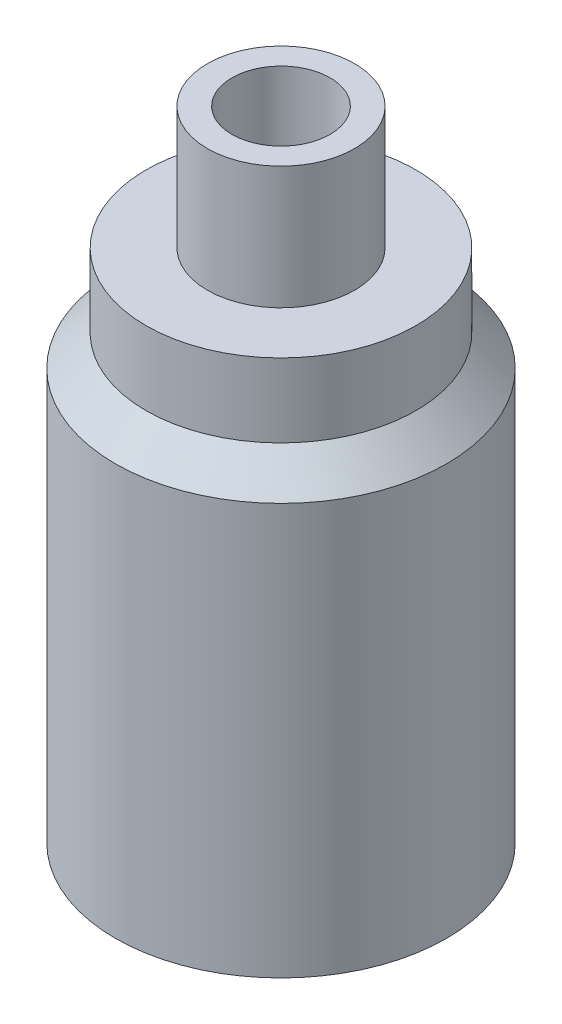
ISO-10303-21;
HEADER;
FILE_DESCRIPTION(('STEP AP214'),'2;1');
FILE_NAME('part.step','',(''),(''),'','','');
FILE_SCHEMA(('AUTOMOTIVE_DESIGN { 1 0 10303 214 1 1 1 1 }'));
ENDSEC;
DATA;
#1=APPLICATION_CONTEXT('core data for automotive mechanical design processes');
#2=APPLICATION_PROTOCOL_DEFINITION('international standard','automotive_design',2000,#1);
#3=PRODUCT_CONTEXT('',#1,'mechanical');
#4=PRODUCT('Part','Part','',(#3));
#5=PRODUCT_RELATED_PRODUCT_CATEGORY('part','',(#4));
#6=PRODUCT_DEFINITION_FORMATION('','',#4);
#7=PRODUCT_DEFINITION_CONTEXT('part definition',#1,'design');
#8=PRODUCT_DEFINITION('design','',#6,#7);
#9=PRODUCT_DEFINITION_SHAPE('','',#8);
#10=(LENGTH_UNIT() NAMED_UNIT(*) SI_UNIT(.MILLI.,.METRE.));
#11=(NAMED_UNIT(*) PLANE_ANGLE_UNIT() SI_UNIT($,.RADIAN.));
#12=(NAMED_UNIT(*) SI_UNIT($,.STERADIAN.) SOLID_ANGLE_UNIT());
#13=UNCERTAINTY_MEASURE_WITH_UNIT(LENGTH_MEASURE(1.E-05),#10,'distance_accuracy_value','');
#14=(GEOMETRIC_REPRESENTATION_CONTEXT(3) GLOBAL_UNCERTAINTY_ASSIGNED_CONTEXT((#13)) GLOBAL_UNIT_ASSIGNED_CONTEXT((#10,
#11,#12)) REPRESENTATION_CONTEXT('',''));
#15=CARTESIAN_POINT('',(0.,0.,0.));
#16=DIRECTION('',(0.,0.,1.));
#17=DIRECTION('',(1.,0.,0.));
#18=AXIS2_PLACEMENT_3D('',#15,#16,#17);
#19=CARTESIAN_POINT('',(0.,21.,0.));
#20=DIRECTION('',(0.,1.,0.));
#21=DIRECTION('',(0.,0.,1.));
#22=AXIS2_PLACEMENT_3D('',#19,#20,#21);
#23=PLANE('',#22);
#24=CARTESIAN_POINT('',(0.,21.,0.));
#25=DIRECTION('',(0.,1.,0.));
#26=DIRECTION('',(0.,0.,1.));
#27=AXIS2_PLACEMENT_3D('',#24,#25,#26);
#28=CIRCLE('',#27,3.);
#29=CARTESIAN_POINT('',(0.,21.,3.));
#30=VERTEX_POINT('',#29);
#31=EDGE_CURVE('E49',#30,#30,#28,.T.);
#32=ORIENTED_EDGE('',*,*,#31,.F.);
#33=EDGE_LOOP('',(#32));
#34=FACE_BOUND('',#33,.T.);
#35=CARTESIAN_POINT('',(0.,21.,0.));
#36=DIRECTION('',(0.,1.,0.));
#37=DIRECTION('',(0.,0.,1.));
#38=AXIS2_PLACEMENT_3D('',#35,#36,#37);
#39=CIRCLE('',#38,5.5);
#40=CARTESIAN_POINT('',(0.,21.,5.5));
#41=VERTEX_POINT('',#40);
#42=EDGE_CURVE('E58',#41,#41,#39,.T.);
#43=ORIENTED_EDGE('',*,*,#42,.T.);
#44=EDGE_LOOP('',(#43));
#45=FACE_BOUND('',#44,.T.);
#46=ADVANCED_FACE('F37',(#34,#45),#23,.T.);
#47=CARTESIAN_POINT('',(0.,21.,0.));
#48=DIRECTION('',(0.,1.,0.));
#49=DIRECTION('',(0.,0.,1.));
#50=AXIS2_PLACEMENT_3D('',#47,#48,#49);
#51=CYLINDRICAL_SURFACE('',#50,3.);
#52=ORIENTED_EDGE('',*,*,#31,.T.);
#53=EDGE_LOOP('',(#52));
#54=FACE_BOUND('',#53,.T.);
#55=CARTESIAN_POINT('',(0.,26.,0.));
#56=DIRECTION('',(0.,1.,0.));
#57=DIRECTION('',(0.,0.,1.));
#58=AXIS2_PLACEMENT_3D('',#55,#56,#57);
#59=CIRCLE('',#58,3.);
#60=CARTESIAN_POINT('',(0.,26.,3.));
#61=VERTEX_POINT('',#60);
#62=EDGE_CURVE('E52',#61,#61,#59,.T.);
#63=ORIENTED_EDGE('',*,*,#62,.F.);
#64=EDGE_LOOP('',(#63));
#65=FACE_BOUND('',#64,.T.);
#66=ADVANCED_FACE('F89',(#54,#65),#51,.T.);
#67=CARTESIAN_POINT('',(0.,26.,0.));
#68=DIRECTION('',(0.,1.,0.));
#69=DIRECTION('',(0.,0.,1.));
#70=AXIS2_PLACEMENT_3D('',#67,#68,#69);
#71=PLANE('',#70);
#72=CARTESIAN_POINT('',(0.,26.,0.));
#73=DIRECTION('',(0.,1.,0.));
#74=DIRECTION('',(0.,0.,1.));
#75=AXIS2_PLACEMENT_3D('',#72,#73,#74);
#76=CIRCLE('',#75,2.);
#77=CARTESIAN_POINT('',(0.,26.,2.));
#78=VERTEX_POINT('',#77);
#79=EDGE_CURVE('E69',#78,#78,#76,.T.);
#80=ORIENTED_EDGE('',*,*,#79,.F.);
#81=EDGE_LOOP('',(#80));
#82=FACE_BOUND('',#81,.T.);
#83=ORIENTED_EDGE('',*,*,#62,.T.);
#84=EDGE_LOOP('',(#83));
#85=FACE_BOUND('',#84,.T.);
#86=ADVANCED_FACE('F95',(#82,#85),#71,.T.);
#87=CARTESIAN_POINT('',(0.,18.,0.));
#88=DIRECTION('',(0.,1.,0.));
#89=DIRECTION('',(0.,0.,1.));
#90=AXIS2_PLACEMENT_3D('',#87,#88,#89);
#91=CYLINDRICAL_SURFACE('',#90,5.5);
#92=CARTESIAN_POINT('',(0.,18.,0.));
#93=DIRECTION('',(0.,1.,0.));
#94=DIRECTION('',(0.,0.,1.));
#95=AXIS2_PLACEMENT_3D('',#92,#93,#94);
#96=CIRCLE('',#95,5.5);
#97=CARTESIAN_POINT('',(0.,18.,-5.50000000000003));
#98=VERTEX_POINT('',#97);
#99=EDGE_CURVE('E55',#98,#98,#96,.T.);
#100=ORIENTED_EDGE('',*,*,#99,.T.);
#101=EDGE_LOOP('',(#100));
#102=FACE_BOUND('',#101,.T.);
#103=ORIENTED_EDGE('',*,*,#42,.F.);
#104=EDGE_LOOP('',(#103));
#105=FACE_BOUND('',#104,.T.);
#106=ADVANCED_FACE('F104',(#102,#105),#91,.T.);
#107=CARTESIAN_POINT('',(0.,0.,0.));
#108=DIRECTION('',(0.,1.,0.));
#109=DIRECTION('',(0.,0.,1.));
#110=AXIS2_PLACEMENT_3D('',#107,#108,#109);
#111=PLANE('',#110);
#112=CARTESIAN_POINT('',(0.,0.,0.));
#113=DIRECTION('',(0.,-1.,0.));
#114=DIRECTION('',(0.,0.,-1.));
#115=AXIS2_PLACEMENT_3D('',#112,#113,#114);
#116=CIRCLE('',#115,3.25);
#117=CARTESIAN_POINT('',(0.,0.,-3.25));
#118=VERTEX_POINT('',#117);
#119=EDGE_CURVE('E66',#118,#118,#116,.T.);
#120=ORIENTED_EDGE('',*,*,#119,.F.);
#121=EDGE_LOOP('',(#120));
#122=FACE_BOUND('',#121,.T.);
#123=CARTESIAN_POINT('',(0.,0.,0.));
#124=DIRECTION('',(0.,1.,0.));
#125=DIRECTION('',(0.,0.,1.));
#126=AXIS2_PLACEMENT_3D('',#123,#124,#125);
#127=CIRCLE('',#126,6.75);
#128=CARTESIAN_POINT('',(0.,0.,-6.75));
#129=VERTEX_POINT('',#128);
#130=EDGE_CURVE('E45',#129,#129,#127,.T.);
#131=ORIENTED_EDGE('',*,*,#130,.F.);
#132=EDGE_LOOP('',(#131));
#133=FACE_BOUND('',#132,.T.);
#134=ADVANCED_FACE('F106',(#122,#133),#111,.F.);
#135=CARTESIAN_POINT('',(0.,26.,0.));
#136=DIRECTION('',(0.,-1.,0.));
#137=DIRECTION('',(0.,0.,-1.));
#138=AXIS2_PLACEMENT_3D('',#135,#136,#137);
#139=CYLINDRICAL_SURFACE('',#138,6.75);
#140=CARTESIAN_POINT('',(0.,16.75,0.));
#141=DIRECTION('',(0.,1.,0.));
#142=DIRECTION('',(0.,0.,1.));
#143=AXIS2_PLACEMENT_3D('',#140,#141,#142);
#144=CIRCLE('',#143,6.75);
#145=CARTESIAN_POINT('',(0.,16.75,-6.75));
#146=VERTEX_POINT('',#145);
#147=EDGE_CURVE('E11',#146,#146,#144,.F.);
#148=CARTESIAN_POINT('',(0.,16.75,-6.75));
#149=CARTESIAN_POINT('',(0.,16.5755208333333,-6.75));
#150=CARTESIAN_POINT('',(0.,16.4010416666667,-6.75));
#151=CARTESIAN_POINT('',(0.,16.0520833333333,-6.75));
#152=CARTESIAN_POINT('',(0.,15.8776041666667,-6.75));
#153=CARTESIAN_POINT('',(0.,15.5286458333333,-6.75));
#154=CARTESIAN_POINT('',(0.,15.3541666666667,-6.75));
#155=CARTESIAN_POINT('',(0.,15.0052083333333,-6.75));
#156=CARTESIAN_POINT('',(0.,14.8307291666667,-6.75));
#157=CARTESIAN_POINT('',(0.,14.4817708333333,-6.75));
#158=CARTESIAN_POINT('',(0.,14.3072916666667,-6.75));
#159=CARTESIAN_POINT('',(0.,13.9583333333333,-6.75));
#160=CARTESIAN_POINT('',(0.,13.7838541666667,-6.75));
#161=CARTESIAN_POINT('',(0.,13.4348958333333,-6.75));
#162=CARTESIAN_POINT('',(0.,13.2604166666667,-6.75));
#163=CARTESIAN_POINT('',(0.,12.9114583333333,-6.75));
#164=CARTESIAN_POINT('',(0.,12.7369791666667,-6.75));
#165=CARTESIAN_POINT('',(0.,12.3880208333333,-6.75));
#166=CARTESIAN_POINT('',(0.,12.2135416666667,-6.75));
#167=CARTESIAN_POINT('',(0.,11.8645833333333,-6.75));
#168=CARTESIAN_POINT('',(0.,11.6901041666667,-6.75));
#169=CARTESIAN_POINT('',(0.,11.3411458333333,-6.75));
#170=CARTESIAN_POINT('',(0.,11.1666666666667,-6.75));
#171=CARTESIAN_POINT('',(0.,10.8177083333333,-6.75));
#172=CARTESIAN_POINT('',(0.,10.6432291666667,-6.75));
#173=CARTESIAN_POINT('',(0.,10.2942708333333,-6.75));
#174=CARTESIAN_POINT('',(0.,10.1197916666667,-6.75));
#175=CARTESIAN_POINT('',(0.,9.77083333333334,-6.75));
#176=CARTESIAN_POINT('',(0.,9.59635416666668,-6.75));
#177=CARTESIAN_POINT('',(0.,9.24739583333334,-6.75));
#178=CARTESIAN_POINT('',(0.,9.07291666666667,-6.75));
#179=CARTESIAN_POINT('',(0.,8.72395833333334,-6.75));
#180=CARTESIAN_POINT('',(0.,8.54947916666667,-6.75));
#181=CARTESIAN_POINT('',(0.,8.20052083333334,-6.75));
#182=CARTESIAN_POINT('',(0.,8.02604166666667,-6.75));
#183=CARTESIAN_POINT('',(0.,7.67708333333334,-6.75));
#184=CARTESIAN_POINT('',(0.,7.50260416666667,-6.75));
#185=CARTESIAN_POINT('',(0.,7.15364583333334,-6.75));
#186=CARTESIAN_POINT('',(0.,6.97916666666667,-6.75));
#187=CARTESIAN_POINT('',(0.,6.63020833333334,-6.75));
#188=CARTESIAN_POINT('',(0.,6.45572916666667,-6.75));
#189=CARTESIAN_POINT('',(0.,6.10677083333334,-6.75));
#190=CARTESIAN_POINT('',(0.,5.93229166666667,-6.75));
#191=CARTESIAN_POINT('',(0.,5.58333333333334,-6.75));
#192=CARTESIAN_POINT('',(0.,5.40885416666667,-6.75));
#193=CARTESIAN_POINT('',(0.,5.05989583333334,-6.75));
#194=CARTESIAN_POINT('',(0.,4.88541666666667,-6.75));
#195=CARTESIAN_POINT('',(0.,4.53645833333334,-6.75));
#196=CARTESIAN_POINT('',(0.,4.36197916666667,-6.75));
#197=CARTESIAN_POINT('',(0.,4.01302083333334,-6.75));
#198=CARTESIAN_POINT('',(0.,3.83854166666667,-6.75));
#199=CARTESIAN_POINT('',(0.,3.48958333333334,-6.75));
#200=CARTESIAN_POINT('',(0.,3.31510416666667,-6.75));
#201=CARTESIAN_POINT('',(0.,2.96614583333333,-6.75));
#202=CARTESIAN_POINT('',(0.,2.79166666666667,-6.75));
#203=CARTESIAN_POINT('',(0.,2.44270833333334,-6.75));
#204=CARTESIAN_POINT('',(0.,2.26822916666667,-6.75));
#205=CARTESIAN_POINT('',(0.,1.91927083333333,-6.75));
#206=CARTESIAN_POINT('',(0.,1.74479166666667,-6.75));
#207=CARTESIAN_POINT('',(0.,1.39583333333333,-6.75));
#208=CARTESIAN_POINT('',(0.,1.22135416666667,-6.75));
#209=CARTESIAN_POINT('',(0.,0.872395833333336,-6.75));
#210=CARTESIAN_POINT('',(0.,0.697916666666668,-6.75));
#211=CARTESIAN_POINT('',(0.,0.348958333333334,-6.75));
#212=CARTESIAN_POINT('',(0.,0.174479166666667,-6.75));
#213=CARTESIAN_POINT('',(0.,0.,-6.75));
#214=B_SPLINE_CURVE_WITH_KNOTS('',3,(#148,#149,#150,#151,#152,#153,#154,#155,#156,#157,#158,
#159,#160,#161,#162,#163,#164,#165,#166,#167,#168,#169,#170,#171,#172,#173,#174,#175,#176,#177,
#178,#179,#180,#181,#182,#183,#184,#185,#186,#187,#188,#189,#190,#191,#192,#193,#194,#195,#196,
#197,#198,#199,#200,#201,#202,#203,#204,#205,#206,#207,#208,#209,#210,#211,#212,#213),
.UNSPECIFIED.,.F.,.F.,(4,2,2,2,2,2,2,2,2,2,2,2,2,2,2,2,2,2,2,2,2,2,2,2,2,2,2,2,2,2,2,2,4),(0.,
0.523437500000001,1.046875,1.5703125,2.09375,2.6171875,3.140625,3.6640625,4.18750000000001,
4.71093750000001,5.23437500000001,5.75781250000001,6.28125000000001,6.80468750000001,7.328125,
7.85156250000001,8.37500000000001,8.89843750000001,9.42187500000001,9.94531250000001,10.46875,
10.9921875,11.515625,12.0390625,12.5625,13.0859375,13.609375,14.1328125,14.65625,15.1796875,
15.703125,16.2265625,16.75),.UNSPECIFIED.);
#215=EDGE_CURVE('BSEAM108',#146,#129,#214,.T.);
#216=ORIENTED_EDGE('',*,*,#147,.T.);
#217=ORIENTED_EDGE('',*,*,#130,.T.);
#218=ORIENTED_EDGE('',*,*,#215,.T.);
#219=ORIENTED_EDGE('',*,*,#215,.F.);
#220=EDGE_LOOP('',(#216,#218,#217,#219));
#221=FACE_BOUND('',#220,.T.);
#222=ADVANCED_FACE('F108',(#221),#139,.T.);
#223=CARTESIAN_POINT('',(0.,18.,0.));
#224=DIRECTION('',(0.,-1.,0.));
#225=DIRECTION('',(0.,0.,-1.));
#226=AXIS2_PLACEMENT_3D('',#223,#224,#225);
#227=CONICAL_SURFACE('',#226,5.50000000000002,0.785398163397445);
#228=CARTESIAN_POINT('',(0.,16.75,-6.75));
#229=CARTESIAN_POINT('',(0.,16.7630208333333,-6.73697916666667));
#230=CARTESIAN_POINT('',(0.,16.7760416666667,-6.72395833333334));
#231=CARTESIAN_POINT('',(0.,16.8020833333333,-6.69791666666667));
#232=CARTESIAN_POINT('',(0.,16.8151041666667,-6.68489583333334));
#233=CARTESIAN_POINT('',(0.,16.8411458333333,-6.65885416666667));
#234=CARTESIAN_POINT('',(0.,16.8541666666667,-6.64583333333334));
#235=CARTESIAN_POINT('',(0.,16.8802083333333,-6.61979166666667));
#236=CARTESIAN_POINT('',(0.,16.8932291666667,-6.60677083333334));
#237=CARTESIAN_POINT('',(0.,16.9192708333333,-6.58072916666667));
#238=CARTESIAN_POINT('',(0.,16.9322916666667,-6.56770833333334));
#239=CARTESIAN_POINT('',(0.,16.9583333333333,-6.54166666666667));
#240=CARTESIAN_POINT('',(0.,16.9713541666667,-6.52864583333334));
#241=CARTESIAN_POINT('',(0.,16.9973958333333,-6.50260416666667));
#242=CARTESIAN_POINT('',(0.,17.0104166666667,-6.48958333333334));
#243=CARTESIAN_POINT('',(0.,17.0364583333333,-6.46354166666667));
#244=CARTESIAN_POINT('',(0.,17.0494791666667,-6.45052083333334));
#245=CARTESIAN_POINT('',(0.,17.0755208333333,-6.42447916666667));
#246=CARTESIAN_POINT('',(0.,17.0885416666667,-6.41145833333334));
#247=CARTESIAN_POINT('',(0.,17.1145833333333,-6.38541666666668));
#248=CARTESIAN_POINT('',(0.,17.1276041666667,-6.37239583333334));
#249=CARTESIAN_POINT('',(0.,17.1536458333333,-6.34635416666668));
#250=CARTESIAN_POINT('',(0.,17.1666666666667,-6.33333333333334));
#251=CARTESIAN_POINT('',(0.,17.1927083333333,-6.30729166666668));
#252=CARTESIAN_POINT('',(0.,17.2057291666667,-6.29427083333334));
#253=CARTESIAN_POINT('',(0.,17.2317708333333,-6.26822916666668));
#254=CARTESIAN_POINT('',(0.,17.2447916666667,-6.25520833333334));
#255=CARTESIAN_POINT('',(0.,17.2708333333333,-6.22916666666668));
#256=CARTESIAN_POINT('',(0.,17.2838541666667,-6.21614583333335));
#257=CARTESIAN_POINT('',(0.,17.3098958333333,-6.19010416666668));
#258=CARTESIAN_POINT('',(0.,17.3229166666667,-6.17708333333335));
#259=CARTESIAN_POINT('',(0.,17.3489583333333,-6.15104166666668));
#260=CARTESIAN_POINT('',(0.,17.3619791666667,-6.13802083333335));
#261=CARTESIAN_POINT('',(0.,17.3880208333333,-6.11197916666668));
#262=CARTESIAN_POINT('',(0.,17.4010416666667,-6.09895833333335));
#263=CARTESIAN_POINT('',(0.,17.4270833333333,-6.07291666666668));
#264=CARTESIAN_POINT('',(0.,17.4401041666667,-6.05989583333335));
#265=CARTESIAN_POINT('',(0.,17.4661458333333,-6.03385416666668));
#266=CARTESIAN_POINT('',(0.,17.4791666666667,-6.02083333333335));
#267=CARTESIAN_POINT('',(0.,17.5052083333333,-5.99479166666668));
#268=CARTESIAN_POINT('',(0.,17.5182291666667,-5.98177083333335));
#269=CARTESIAN_POINT('',(0.,17.5442708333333,-5.95572916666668));
#270=CARTESIAN_POINT('',(0.,17.5572916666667,-5.94270833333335));
#271=CARTESIAN_POINT('',(0.,17.5833333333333,-5.91666666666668));
#272=CARTESIAN_POINT('',(0.,17.5963541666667,-5.90364583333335));
#273=CARTESIAN_POINT('',(0.,17.6223958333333,-5.87760416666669));
#274=CARTESIAN_POINT('',(0.,17.6354166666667,-5.86458333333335));
#275=CARTESIAN_POINT('',(0.,17.6614583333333,-5.83854166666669));
#276=CARTESIAN_POINT('',(0.,17.6744791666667,-5.82552083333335));
#277=CARTESIAN_POINT('',(0.,17.7005208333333,-5.79947916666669));
#278=CARTESIAN_POINT('',(0.,17.7135416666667,-5.78645833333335));
#279=CARTESIAN_POINT('',(0.,17.7395833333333,-5.76041666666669));
#280=CARTESIAN_POINT('',(0.,17.7526041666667,-5.74739583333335));
#281=CARTESIAN_POINT('',(0.,17.7786458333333,-5.72135416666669));
#282=CARTESIAN_POINT('',(0.,17.7916666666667,-5.70833333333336));
#283=CARTESIAN_POINT('',(0.,17.8177083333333,-5.68229166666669));
#284=CARTESIAN_POINT('',(0.,17.8307291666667,-5.66927083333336));
#285=CARTESIAN_POINT('',(0.,17.8567708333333,-5.64322916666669));
#286=CARTESIAN_POINT('',(0.,17.8697916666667,-5.63020833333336));
#287=CARTESIAN_POINT('',(0.,17.8958333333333,-5.60416666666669));
#288=CARTESIAN_POINT('',(0.,17.9088541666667,-5.59114583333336));
#289=CARTESIAN_POINT('',(0.,17.9348958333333,-5.56510416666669));
#290=CARTESIAN_POINT('',(0.,17.9479166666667,-5.55208333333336));
#291=CARTESIAN_POINT('',(0.,17.9739583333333,-5.52604166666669));
#292=CARTESIAN_POINT('',(0.,17.9869791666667,-5.51302083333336));
#293=CARTESIAN_POINT('',(0.,18.,-5.50000000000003));
#294=B_SPLINE_CURVE_WITH_KNOTS('',3,(#228,#229,#230,#231,#232,#233,#234,#235,#236,#237,#238,
#239,#240,#241,#242,#243,#244,#245,#246,#247,#248,#249,#250,#251,#252,#253,#254,#255,#256,#257,
#258,#259,#260,#261,#262,#263,#264,#265,#266,#267,#268,#269,#270,#271,#272,#273,#274,#275,#276,
#277,#278,#279,#280,#281,#282,#283,#284,#285,#286,#287,#288,#289,#290,#291,#292,#293),
.UNSPECIFIED.,.F.,.F.,(4,2,2,2,2,2,2,2,2,2,2,2,2,2,2,2,2,2,2,2,2,2,2,2,2,2,2,2,2,2,2,2,4),(0.,
0.0552427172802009,0.110485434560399,0.165728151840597,0.220970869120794,0.276213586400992,
0.33145630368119,0.386699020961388,0.441941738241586,0.497184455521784,0.552427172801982,
0.60766989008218,0.66291260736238,0.718155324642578,0.773398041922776,0.828640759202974,
0.883883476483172,0.93912619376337,0.994368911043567,1.04961162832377,1.10485434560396,
1.16009706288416,1.21533978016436,1.27058249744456,1.32582521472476,1.38106793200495,
1.43631064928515,1.49155336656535,1.54679608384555,1.60203880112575,1.65728151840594,
1.71252423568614,1.76776695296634),.UNSPECIFIED.);
#295=EDGE_CURVE('BSEAM39',#146,#98,#294,.T.);
#296=ORIENTED_EDGE('',*,*,#147,.F.);
#297=ORIENTED_EDGE('',*,*,#99,.F.);
#298=ORIENTED_EDGE('',*,*,#295,.T.);
#299=ORIENTED_EDGE('',*,*,#295,.F.);
#300=EDGE_LOOP('',(#296,#298,#297,#299));
#301=FACE_BOUND('',#300,.T.);
#302=ADVANCED_FACE('F39',(#301),#227,.T.);
#303=CARTESIAN_POINT('',(0.,16.,0.));
#304=DIRECTION('',(0.,-1.,0.));
#305=DIRECTION('',(0.,0.,-1.));
#306=AXIS2_PLACEMENT_3D('',#303,#304,#305);
#307=CONICAL_SURFACE('',#306,3.25,1.0471975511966);
#308=CARTESIAN_POINT('',(0.,16.721687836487,0.));
#309=DIRECTION('',(0.,-1.,0.));
#310=DIRECTION('',(0.,0.,-1.));
#311=AXIS2_PLACEMENT_3D('',#308,#309,#310);
#312=CIRCLE('',#311,2.);
#313=CARTESIAN_POINT('',(0.,16.721687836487,2.));
#314=VERTEX_POINT('',#313);
#315=EDGE_CURVE('E41',#314,#314,#312,.F.);
#316=ORIENTED_EDGE('',*,*,#315,.T.);
#317=EDGE_LOOP('',(#316));
#318=FACE_BOUND('',#317,.T.);
#319=CARTESIAN_POINT('',(0.,16.,0.));
#320=DIRECTION('',(0.,-1.,0.));
#321=DIRECTION('',(0.,0.,-1.));
#322=AXIS2_PLACEMENT_3D('',#319,#320,#321);
#323=CIRCLE('',#322,3.25);
#324=CARTESIAN_POINT('',(0.,16.,-3.25));
#325=VERTEX_POINT('',#324);
#326=EDGE_CURVE('E61',#325,#325,#323,.T.);
#327=ORIENTED_EDGE('',*,*,#326,.T.);
#328=EDGE_LOOP('',(#327));
#329=FACE_BOUND('',#328,.T.);
#330=ADVANCED_FACE('F76',(#318,#329),#307,.F.);
#331=CARTESIAN_POINT('',(0.,0.,0.));
#332=DIRECTION('',(0.,-1.,0.));
#333=DIRECTION('',(0.,0.,-1.));
#334=AXIS2_PLACEMENT_3D('',#331,#332,#333);
#335=CYLINDRICAL_SURFACE('',#334,3.25);
#336=ORIENTED_EDGE('',*,*,#326,.F.);
#337=EDGE_LOOP('',(#336));
#338=FACE_BOUND('',#337,.T.);
#339=ORIENTED_EDGE('',*,*,#119,.T.);
#340=EDGE_LOOP('',(#339));
#341=FACE_BOUND('',#340,.T.);
#342=ADVANCED_FACE('F81',(#338,#341),#335,.F.);
#343=CARTESIAN_POINT('',(0.,0.,0.));
#344=DIRECTION('',(0.,1.,0.));
#345=DIRECTION('',(0.,0.,1.));
#346=AXIS2_PLACEMENT_3D('',#343,#344,#345);
#347=CYLINDRICAL_SURFACE('',#346,2.);
#348=CARTESIAN_POINT('',(0.,26.,2.));
#349=CARTESIAN_POINT('',(0.,25.9033509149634,2.));
#350=CARTESIAN_POINT('',(0.,25.8067018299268,2.));
#351=CARTESIAN_POINT('',(0.,25.6134036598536,2.));
#352=CARTESIAN_POINT('',(0.,25.516754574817,2.));
#353=CARTESIAN_POINT('',(0.,25.3234564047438,2.));
#354=CARTESIAN_POINT('',(0.,25.2268073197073,2.));
#355=CARTESIAN_POINT('',(0.,25.0335091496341,2.));
#356=CARTESIAN_POINT('',(0.,24.9368600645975,2.));
#357=CARTESIAN_POINT('',(0.,24.7435618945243,2.));
#358=CARTESIAN_POINT('',(0.,24.6469128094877,2.));
#359=CARTESIAN_POINT('',(0.,24.4536146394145,2.));
#360=CARTESIAN_POINT('',(0.,24.3569655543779,2.));
#361=CARTESIAN_POINT('',(0.,24.1636673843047,2.));
#362=CARTESIAN_POINT('',(0.,24.0670182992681,2.));
#363=CARTESIAN_POINT('',(0.,23.8737201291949,2.));
#364=CARTESIAN_POINT('',(0.,23.7770710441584,2.));
#365=CARTESIAN_POINT('',(0.,23.5837728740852,2.));
#366=CARTESIAN_POINT('',(0.,23.4871237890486,2.));
#367=CARTESIAN_POINT('',(0.,23.2938256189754,2.));
#368=CARTESIAN_POINT('',(0.,23.1971765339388,2.));
#369=CARTESIAN_POINT('',(0.,23.0038783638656,2.));
#370=CARTESIAN_POINT('',(0.,22.907229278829,2.));
#371=CARTESIAN_POINT('',(0.,22.7139311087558,2.));
#372=CARTESIAN_POINT('',(0.,22.6172820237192,2.));
#373=CARTESIAN_POINT('',(0.,22.423983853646,2.));
#374=CARTESIAN_POINT('',(0.,22.3273347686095,2.));
#375=CARTESIAN_POINT('',(0.,22.1340365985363,2.));
#376=CARTESIAN_POINT('',(0.,22.0373875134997,2.));
#377=CARTESIAN_POINT('',(0.,21.8440893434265,2.));
#378=CARTESIAN_POINT('',(0.,21.7474402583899,2.));
#379=CARTESIAN_POINT('',(0.,21.5541420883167,2.));
#380=CARTESIAN_POINT('',(0.,21.4574930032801,2.));
#381=CARTESIAN_POINT('',(0.,21.2641948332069,2.));
#382=CARTESIAN_POINT('',(0.,21.1675457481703,2.));
#383=CARTESIAN_POINT('',(0.,20.9742475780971,2.));
#384=CARTESIAN_POINT('',(0.,20.8775984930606,2.));
#385=CARTESIAN_POINT('',(0.,20.6843003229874,2.));
#386=CARTESIAN_POINT('',(0.,20.5876512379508,2.));
#387=CARTESIAN_POINT('',(0.,20.3943530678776,2.));
#388=CARTESIAN_POINT('',(0.,20.297703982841,2.));
#389=CARTESIAN_POINT('',(0.,20.1044058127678,2.));
#390=CARTESIAN_POINT('',(0.,20.0077567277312,2.));
#391=CARTESIAN_POINT('',(0.,19.814458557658,2.));
#392=CARTESIAN_POINT('',(0.,19.7178094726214,2.));
#393=CARTESIAN_POINT('',(0.,19.5245113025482,2.));
#394=CARTESIAN_POINT('',(0.,19.4278622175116,2.));
#395=CARTESIAN_POINT('',(0.,19.2345640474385,2.));
#396=CARTESIAN_POINT('',(0.,19.1379149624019,2.));
#397=CARTESIAN_POINT('',(0.,18.9446167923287,2.));
#398=CARTESIAN_POINT('',(0.,18.8479677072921,2.));
#399=CARTESIAN_POINT('',(0.,18.6546695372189,2.));
#400=CARTESIAN_POINT('',(0.,18.5580204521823,2.));
#401=CARTESIAN_POINT('',(0.,18.3647222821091,2.));
#402=CARTESIAN_POINT('',(0.,18.2680731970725,2.));
#403=CARTESIAN_POINT('',(0.,18.0747750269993,2.));
#404=CARTESIAN_POINT('',(0.,17.9781259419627,2.));
#405=CARTESIAN_POINT('',(0.,17.7848277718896,2.));
#406=CARTESIAN_POINT('',(0.,17.688178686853,2.));
#407=CARTESIAN_POINT('',(0.,17.4948805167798,2.));
#408=CARTESIAN_POINT('',(0.,17.3982314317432,2.));
#409=CARTESIAN_POINT('',(0.,17.20493326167,2.));
#410=CARTESIAN_POINT('',(0.,17.1082841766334,2.));
#411=CARTESIAN_POINT('',(0.,16.9149860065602,2.));
#412=CARTESIAN_POINT('',(0.,16.8183369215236,2.));
#413=CARTESIAN_POINT('',(0.,16.721687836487,2.));
#414=B_SPLINE_CURVE_WITH_KNOTS('',3,(#348,#349,#350,#351,#352,#353,#354,#355,#356,#357,#358,
#359,#360,#361,#362,#363,#364,#365,#366,#367,#368,#369,#370,#371,#372,#373,#374,#375,#376,#377,
#378,#379,#380,#381,#382,#383,#384,#385,#386,#387,#388,#389,#390,#391,#392,#393,#394,#395,#396,
#397,#398,#399,#400,#401,#402,#403,#404,#405,#406,#407,#408,#409,#410,#411,#412,#413),
.UNSPECIFIED.,.F.,.F.,(4,2,2,2,2,2,2,2,2,2,2,2,2,2,2,2,2,2,2,2,2,2,2,2,2,2,2,2,2,2,2,2,4),(0.,
0.289947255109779,0.579894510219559,0.869841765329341,1.15978902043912,1.4497362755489,
1.73968353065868,2.02963078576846,2.31957804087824,2.60952529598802,2.8994725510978,
3.18941980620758,3.47936706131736,3.76931431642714,4.05926157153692,4.3492088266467,
4.63915608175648,4.92910333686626,5.21905059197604,5.50899784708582,5.7989451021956,
6.08889235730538,6.37883961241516,6.66878686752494,6.95873412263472,7.2486813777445,
7.53862863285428,7.82857588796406,8.11852314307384,8.40847039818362,8.69841765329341,
8.98836490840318,9.27831216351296),.UNSPECIFIED.);
#415=EDGE_CURVE('BSEAM79',#78,#314,#414,.T.);
#416=ORIENTED_EDGE('',*,*,#79,.T.);
#417=ORIENTED_EDGE('',*,*,#315,.F.);
#418=ORIENTED_EDGE('',*,*,#415,.T.);
#419=ORIENTED_EDGE('',*,*,#415,.F.);
#420=EDGE_LOOP('',(#416,#418,#417,#419));
#421=FACE_BOUND('',#420,.T.);
#422=ADVANCED_FACE('F79',(#421),#347,.F.);
#423=CLOSED_SHELL('',(#46,#66,#86,#106,#134,#222,#302,#330,#342,#422));
#424=MANIFOLD_SOLID_BREP('B2',#423);
#425=ADVANCED_BREP_SHAPE_REPRESENTATION('',(#18,#424),#14);
#426=SHAPE_DEFINITION_REPRESENTATION(#9,#425);
ENDSEC;
END-ISO-10303-21;
